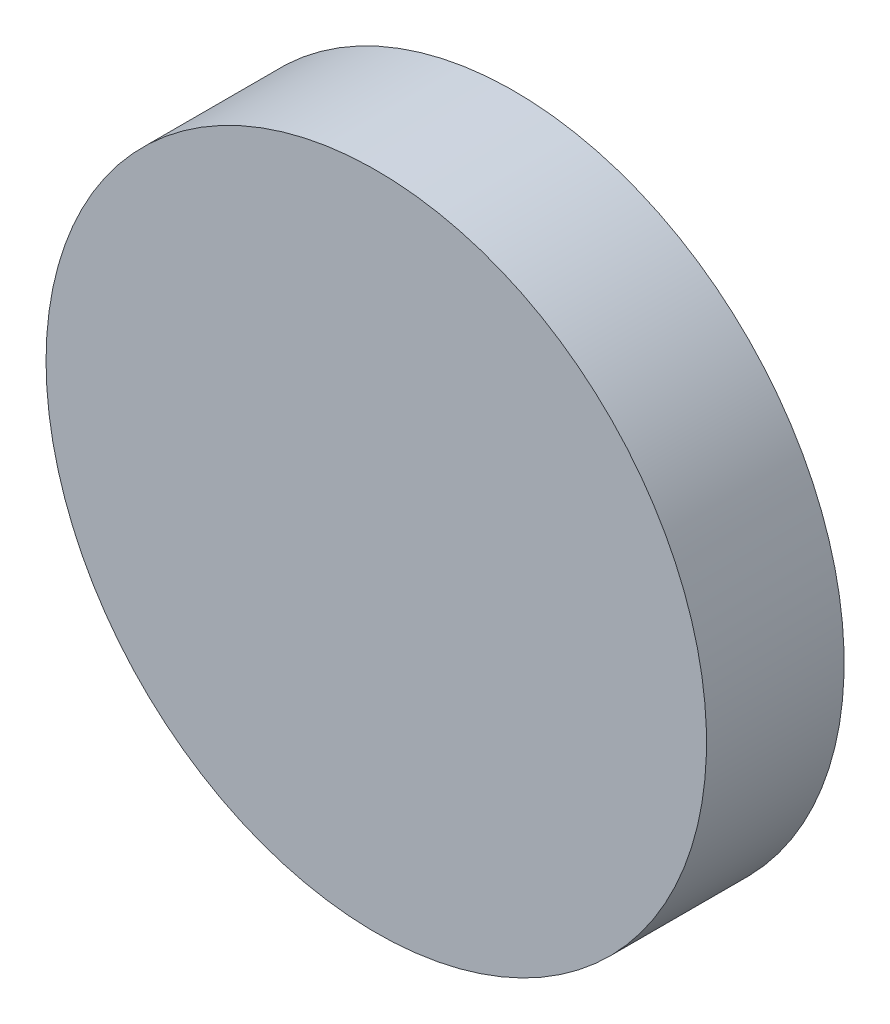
ISO-10303-21;
HEADER;
FILE_DESCRIPTION(('STEP AP214'),'2;1');
FILE_NAME('part.step','',(''),(''),'','','');
FILE_SCHEMA(('AUTOMOTIVE_DESIGN { 1 0 10303 214 1 1 1 1 }'));
ENDSEC;
DATA;
#1=APPLICATION_CONTEXT('core data for automotive mechanical design processes');
#2=APPLICATION_PROTOCOL_DEFINITION('international standard','automotive_design',2000,#1);
#3=PRODUCT_CONTEXT('',#1,'mechanical');
#4=PRODUCT('Part','Part','',(#3));
#5=PRODUCT_RELATED_PRODUCT_CATEGORY('part','',(#4));
#6=PRODUCT_DEFINITION_FORMATION('','',#4);
#7=PRODUCT_DEFINITION_CONTEXT('part definition',#1,'design');
#8=PRODUCT_DEFINITION('design','',#6,#7);
#9=PRODUCT_DEFINITION_SHAPE('','',#8);
#10=(LENGTH_UNIT() NAMED_UNIT(*) SI_UNIT(.MILLI.,.METRE.));
#11=(NAMED_UNIT(*) PLANE_ANGLE_UNIT() SI_UNIT($,.RADIAN.));
#12=(NAMED_UNIT(*) SI_UNIT($,.STERADIAN.) SOLID_ANGLE_UNIT());
#13=UNCERTAINTY_MEASURE_WITH_UNIT(LENGTH_MEASURE(1.E-05),#10,'distance_accuracy_value','');
#14=(GEOMETRIC_REPRESENTATION_CONTEXT(3) GLOBAL_UNCERTAINTY_ASSIGNED_CONTEXT((#13)) GLOBAL_UNIT_ASSIGNED_CONTEXT((#10,
#11,#12)) REPRESENTATION_CONTEXT('',''));
#15=CARTESIAN_POINT('',(0.,0.,0.));
#16=DIRECTION('',(0.,0.,1.));
#17=DIRECTION('',(1.,0.,0.));
#18=AXIS2_PLACEMENT_3D('',#15,#16,#17);
#19=CARTESIAN_POINT('',(0.,0.,9.525));
#20=DIRECTION('',(0.,0.,-1.));
#21=DIRECTION('',(-1.,0.,0.));
#22=AXIS2_PLACEMENT_3D('',#19,#20,#21);
#23=CYLINDRICAL_SURFACE('',#22,22.86);
#24=CARTESIAN_POINT('',(0.,0.,9.525));
#25=DIRECTION('',(0.,0.,1.));
#26=DIRECTION('',(1.,0.,0.));
#27=AXIS2_PLACEMENT_3D('',#24,#25,#26);
#28=CIRCLE('',#27,22.86);
#29=CARTESIAN_POINT('',(-22.86,0.,9.525));
#30=VERTEX_POINT('',#29);
#31=EDGE_CURVE('E10',#30,#30,#28,.T.);
#32=CARTESIAN_POINT('',(0.,0.,0.));
#33=DIRECTION('',(0.,0.,1.));
#34=DIRECTION('',(1.,0.,0.));
#35=AXIS2_PLACEMENT_3D('',#32,#33,#34);
#36=CIRCLE('',#35,22.86);
#37=CARTESIAN_POINT('',(-22.86,0.,0.));
#38=VERTEX_POINT('',#37);
#39=EDGE_CURVE('E38',#38,#38,#36,.T.);
#40=CARTESIAN_POINT('',(-22.86,0.,9.525));
#41=CARTESIAN_POINT('',(-22.86,0.,9.42578125));
#42=CARTESIAN_POINT('',(-22.86,0.,9.3265625));
#43=CARTESIAN_POINT('',(-22.86,0.,9.128125));
#44=CARTESIAN_POINT('',(-22.86,0.,9.02890625));
#45=CARTESIAN_POINT('',(-22.86,0.,8.83046875));
#46=CARTESIAN_POINT('',(-22.86,0.,8.73125));
#47=CARTESIAN_POINT('',(-22.86,0.,8.5328125));
#48=CARTESIAN_POINT('',(-22.86,0.,8.43359375));
#49=CARTESIAN_POINT('',(-22.86,0.,8.23515625));
#50=CARTESIAN_POINT('',(-22.86,0.,8.1359375));
#51=CARTESIAN_POINT('',(-22.86,0.,7.9375));
#52=CARTESIAN_POINT('',(-22.86,0.,7.83828125));
#53=CARTESIAN_POINT('',(-22.86,0.,7.63984375));
#54=CARTESIAN_POINT('',(-22.86,0.,7.540625));
#55=CARTESIAN_POINT('',(-22.86,0.,7.3421875));
#56=CARTESIAN_POINT('',(-22.86,0.,7.24296875));
#57=CARTESIAN_POINT('',(-22.86,0.,7.04453125));
#58=CARTESIAN_POINT('',(-22.86,0.,6.9453125));
#59=CARTESIAN_POINT('',(-22.86,0.,6.746875));
#60=CARTESIAN_POINT('',(-22.86,0.,6.64765625));
#61=CARTESIAN_POINT('',(-22.86,0.,6.44921875));
#62=CARTESIAN_POINT('',(-22.86,0.,6.35));
#63=CARTESIAN_POINT('',(-22.86,0.,6.1515625));
#64=CARTESIAN_POINT('',(-22.86,0.,6.05234375));
#65=CARTESIAN_POINT('',(-22.86,0.,5.85390625));
#66=CARTESIAN_POINT('',(-22.86,0.,5.7546875));
#67=CARTESIAN_POINT('',(-22.86,0.,5.55625));
#68=CARTESIAN_POINT('',(-22.86,0.,5.45703125));
#69=CARTESIAN_POINT('',(-22.86,0.,5.25859375));
#70=CARTESIAN_POINT('',(-22.86,0.,5.159375));
#71=CARTESIAN_POINT('',(-22.86,0.,4.9609375));
#72=CARTESIAN_POINT('',(-22.86,0.,4.86171875));
#73=CARTESIAN_POINT('',(-22.86,0.,4.66328125));
#74=CARTESIAN_POINT('',(-22.86,0.,4.5640625));
#75=CARTESIAN_POINT('',(-22.86,0.,4.365625));
#76=CARTESIAN_POINT('',(-22.86,0.,4.26640625));
#77=CARTESIAN_POINT('',(-22.86,0.,4.06796875));
#78=CARTESIAN_POINT('',(-22.86,0.,3.96875));
#79=CARTESIAN_POINT('',(-22.86,0.,3.7703125));
#80=CARTESIAN_POINT('',(-22.86,0.,3.67109375));
#81=CARTESIAN_POINT('',(-22.86,0.,3.47265625));
#82=CARTESIAN_POINT('',(-22.86,0.,3.3734375));
#83=CARTESIAN_POINT('',(-22.86,0.,3.175));
#84=CARTESIAN_POINT('',(-22.86,0.,3.07578125));
#85=CARTESIAN_POINT('',(-22.86,0.,2.87734375));
#86=CARTESIAN_POINT('',(-22.86,0.,2.778125));
#87=CARTESIAN_POINT('',(-22.86,0.,2.5796875));
#88=CARTESIAN_POINT('',(-22.86,0.,2.48046875));
#89=CARTESIAN_POINT('',(-22.86,0.,2.28203125));
#90=CARTESIAN_POINT('',(-22.86,0.,2.1828125));
#91=CARTESIAN_POINT('',(-22.86,0.,1.984375));
#92=CARTESIAN_POINT('',(-22.86,0.,1.88515625));
#93=CARTESIAN_POINT('',(-22.86,0.,1.68671875));
#94=CARTESIAN_POINT('',(-22.86,0.,1.5875));
#95=CARTESIAN_POINT('',(-22.86,0.,1.3890625));
#96=CARTESIAN_POINT('',(-22.86,0.,1.28984375));
#97=CARTESIAN_POINT('',(-22.86,0.,1.09140625));
#98=CARTESIAN_POINT('',(-22.86,0.,0.992187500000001));
#99=CARTESIAN_POINT('',(-22.86,0.,0.793750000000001));
#100=CARTESIAN_POINT('',(-22.86,0.,0.69453125));
#101=CARTESIAN_POINT('',(-22.86,0.,0.49609375));
#102=CARTESIAN_POINT('',(-22.86,0.,0.396875));
#103=CARTESIAN_POINT('',(-22.86,0.,0.1984375));
#104=CARTESIAN_POINT('',(-22.86,0.,0.0992187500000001));
#105=CARTESIAN_POINT('',(-22.86,0.,0.));
#106=B_SPLINE_CURVE_WITH_KNOTS('',3,(#40,#41,#42,#43,#44,#45,#46,#47,#48,#49,#50,#51,#52,#53,
#54,#55,#56,#57,#58,#59,#60,#61,#62,#63,#64,#65,#66,#67,#68,#69,#70,#71,#72,#73,#74,#75,#76,#77,
#78,#79,#80,#81,#82,#83,#84,#85,#86,#87,#88,#89,#90,#91,#92,#93,#94,#95,#96,#97,#98,#99,#100,
#101,#102,#103,#104,#105),.UNSPECIFIED.,.F.,.F.,(4,2,2,2,2,2,2,2,2,2,2,2,2,2,2,2,2,2,2,2,2,2,2,
2,2,2,2,2,2,2,2,2,4),(0.,0.297656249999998,0.595312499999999,0.892968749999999,1.190625,
1.48828125,1.7859375,2.08359375,2.38125,2.67890625,2.9765625,3.27421875,3.571875,3.86953125,
4.1671875,4.46484375,4.7625,5.06015625,5.3578125,5.65546875,5.953125,6.25078125,6.5484375,
6.84609375,7.14375,7.44140625,7.7390625,8.03671875,8.334375,8.63203125,8.9296875,9.22734375,
9.525),.UNSPECIFIED.);
#107=EDGE_CURVE('BSEAM35',#30,#38,#106,.T.);
#108=ORIENTED_EDGE('',*,*,#31,.F.);
#109=ORIENTED_EDGE('',*,*,#39,.T.);
#110=ORIENTED_EDGE('',*,*,#107,.T.);
#111=ORIENTED_EDGE('',*,*,#107,.F.);
#112=EDGE_LOOP('',(#108,#110,#109,#111));
#113=FACE_BOUND('',#112,.T.);
#114=ADVANCED_FACE('F35',(#113),#23,.T.);
#115=CARTESIAN_POINT('',(0.,0.,9.525));
#116=DIRECTION('',(0.,0.,1.));
#117=DIRECTION('',(1.,0.,0.));
#118=AXIS2_PLACEMENT_3D('',#115,#116,#117);
#119=PLANE('',#118);
#120=ORIENTED_EDGE('',*,*,#31,.T.);
#121=EDGE_LOOP('',(#120));
#122=FACE_BOUND('',#121,.T.);
#123=ADVANCED_FACE('F50',(#122),#119,.T.);
#124=CARTESIAN_POINT('',(0.,0.,0.));
#125=DIRECTION('',(0.,0.,1.));
#126=DIRECTION('',(1.,0.,0.));
#127=AXIS2_PLACEMENT_3D('',#124,#125,#126);
#128=PLANE('',#127);
#129=ORIENTED_EDGE('',*,*,#39,.F.);
#130=EDGE_LOOP('',(#129));
#131=FACE_BOUND('',#130,.T.);
#132=ADVANCED_FACE('F48',(#131),#128,.F.);
#133=CLOSED_SHELL('',(#114,#123,#132));
#134=MANIFOLD_SOLID_BREP('B2',#133);
#135=ADVANCED_BREP_SHAPE_REPRESENTATION('',(#18,#134),#14);
#136=SHAPE_DEFINITION_REPRESENTATION(#9,#135);
ENDSEC;
END-ISO-10303-21;
